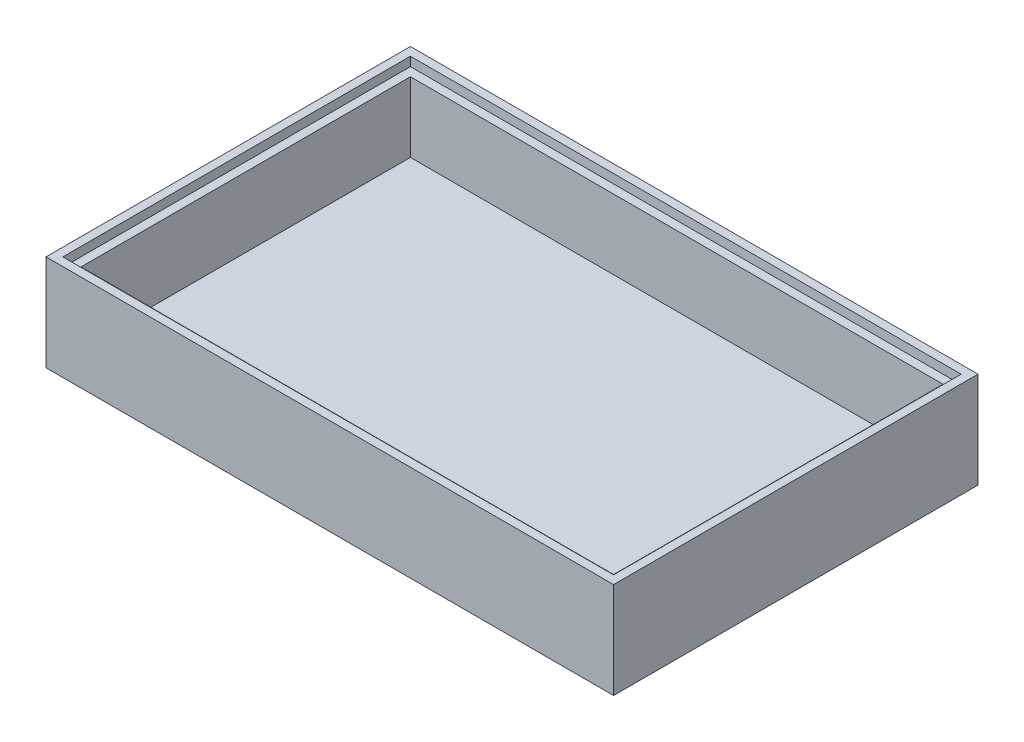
ISO-10303-21;
HEADER;
FILE_DESCRIPTION(('STEP AP214'),'2;1');
FILE_NAME('part.step','',(''),(''),'','','');
FILE_SCHEMA(('AUTOMOTIVE_DESIGN { 1 0 10303 214 1 1 1 1 }'));
ENDSEC;
DATA;
#1=APPLICATION_CONTEXT('core data for automotive mechanical design processes');
#2=APPLICATION_PROTOCOL_DEFINITION('international standard','automotive_design',2000,#1);
#3=PRODUCT_CONTEXT('',#1,'mechanical');
#4=PRODUCT('Part','Part','',(#3));
#5=PRODUCT_RELATED_PRODUCT_CATEGORY('part','',(#4));
#6=PRODUCT_DEFINITION_FORMATION('','',#4);
#7=PRODUCT_DEFINITION_CONTEXT('part definition',#1,'design');
#8=PRODUCT_DEFINITION('design','',#6,#7);
#9=PRODUCT_DEFINITION_SHAPE('','',#8);
#10=(LENGTH_UNIT() NAMED_UNIT(*) SI_UNIT(.MILLI.,.METRE.));
#11=(NAMED_UNIT(*) PLANE_ANGLE_UNIT() SI_UNIT($,.RADIAN.));
#12=(NAMED_UNIT(*) SI_UNIT($,.STERADIAN.) SOLID_ANGLE_UNIT());
#13=UNCERTAINTY_MEASURE_WITH_UNIT(LENGTH_MEASURE(1.E-05),#10,'distance_accuracy_value','');
#14=(GEOMETRIC_REPRESENTATION_CONTEXT(3) GLOBAL_UNCERTAINTY_ASSIGNED_CONTEXT((#13)) GLOBAL_UNIT_ASSIGNED_CONTEXT((#10,
#11,#12)) REPRESENTATION_CONTEXT('',''));
#15=CARTESIAN_POINT('',(0.,0.,0.));
#16=DIRECTION('',(0.,0.,1.));
#17=DIRECTION('',(1.,0.,0.));
#18=AXIS2_PLACEMENT_3D('',#15,#16,#17);
#19=CARTESIAN_POINT('',(0.,20.,83.4381346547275));
#20=DIRECTION('',(0.,1.,0.));
#21=DIRECTION('',(0.,0.,1.));
#22=AXIS2_PLACEMENT_3D('',#19,#20,#21);
#23=PLANE('',#22);
#24=DIRECTION('',(-1.,0.,0.));
#25=VECTOR('',#24,1.);
#26=CARTESIAN_POINT('',(0.,20.,2.));
#27=LINE('',#26,#25);
#28=CARTESIAN_POINT('',(127.966417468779,20.,2.00000000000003));
#29=VERTEX_POINT('',#28);
#30=CARTESIAN_POINT('',(2.,20.,2.));
#31=VERTEX_POINT('',#30);
#32=EDGE_CURVE('E173',#29,#31,#27,.T.);
#33=ORIENTED_EDGE('',*,*,#32,.T.);
#34=DIRECTION('',(0.,0.,1.));
#35=VECTOR('',#34,1.);
#36=CARTESIAN_POINT('',(2.,20.,83.4381346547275));
#37=LINE('',#36,#35);
#38=CARTESIAN_POINT('',(2.,20.,81.4381346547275));
#39=VERTEX_POINT('',#38);
#40=EDGE_CURVE('E170',#31,#39,#37,.T.);
#41=ORIENTED_EDGE('',*,*,#40,.T.);
#42=DIRECTION('',(1.,0.,0.));
#43=VECTOR('',#42,1.);
#44=CARTESIAN_POINT('',(0.,20.,81.4381346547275));
#45=LINE('',#44,#43);
#46=CARTESIAN_POINT('',(127.966417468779,20.,81.4381346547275));
#47=VERTEX_POINT('',#46);
#48=EDGE_CURVE('E69',#39,#47,#45,.T.);
#49=ORIENTED_EDGE('',*,*,#48,.T.);
#50=DIRECTION('',(0.,0.,-1.));
#51=VECTOR('',#50,1.);
#52=CARTESIAN_POINT('',(127.966417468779,20.,83.4381346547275));
#53=LINE('',#52,#51);
#54=EDGE_CURVE('E64',#47,#29,#53,.T.);
#55=ORIENTED_EDGE('',*,*,#54,.T.);
#56=EDGE_LOOP('',(#33,#41,#49,#55));
#57=FACE_BOUND('',#56,.T.);
#58=DIRECTION('',(0.,0.,1.));
#59=VECTOR('',#58,1.);
#60=CARTESIAN_POINT('',(4.,20.,0.));
#61=LINE('',#60,#59);
#62=CARTESIAN_POINT('',(4.,20.,4.));
#63=VERTEX_POINT('',#62);
#64=CARTESIAN_POINT('',(4.,20.,79.4381346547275));
#65=VERTEX_POINT('',#64);
#66=EDGE_CURVE('E216',#63,#65,#61,.T.);
#67=ORIENTED_EDGE('',*,*,#66,.F.);
#68=DIRECTION('',(-1.,0.,0.));
#69=VECTOR('',#68,1.);
#70=CARTESIAN_POINT('',(0.,20.,4.));
#71=LINE('',#70,#69);
#72=CARTESIAN_POINT('',(125.966417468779,20.,4.));
#73=VERTEX_POINT('',#72);
#74=EDGE_CURVE('E206',#73,#63,#71,.T.);
#75=ORIENTED_EDGE('',*,*,#74,.F.);
#76=DIRECTION('',(0.,0.,-1.));
#77=VECTOR('',#76,1.);
#78=CARTESIAN_POINT('',(125.966417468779,20.,0.));
#79=LINE('',#78,#77);
#80=CARTESIAN_POINT('',(125.966417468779,20.,79.4381346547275));
#81=VERTEX_POINT('',#80);
#82=EDGE_CURVE('E220',#81,#73,#79,.T.);
#83=ORIENTED_EDGE('',*,*,#82,.F.);
#84=DIRECTION('',(1.,0.,0.));
#85=VECTOR('',#84,1.);
#86=CARTESIAN_POINT('',(0.,20.,79.4381346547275));
#87=LINE('',#86,#85);
#88=EDGE_CURVE('E218',#65,#81,#87,.T.);
#89=ORIENTED_EDGE('',*,*,#88,.F.);
#90=EDGE_LOOP('',(#67,#75,#83,#89));
#91=FACE_BOUND('',#90,.T.);
#92=ADVANCED_FACE('F49',(#57,#91),#23,.T.);
#93=CARTESIAN_POINT('',(4.,20.,0.));
#94=DIRECTION('',(1.,0.,0.));
#95=DIRECTION('',(0.,0.,-1.));
#96=AXIS2_PLACEMENT_3D('',#93,#94,#95);
#97=PLANE('',#96);
#98=DIRECTION('',(0.,0.,1.));
#99=VECTOR('',#98,1.);
#100=CARTESIAN_POINT('',(4.,4.,0.));
#101=LINE('',#100,#99);
#102=CARTESIAN_POINT('',(4.,4.,4.));
#103=VERTEX_POINT('',#102);
#104=CARTESIAN_POINT('',(4.,4.,79.4381346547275));
#105=VERTEX_POINT('',#104);
#106=EDGE_CURVE('E182',#103,#105,#101,.T.);
#107=ORIENTED_EDGE('',*,*,#106,.F.);
#108=DIRECTION('',(0.,-1.,0.));
#109=VECTOR('',#108,1.);
#110=CARTESIAN_POINT('',(4.,20.,4.));
#111=LINE('',#110,#109);
#112=EDGE_CURVE('E202',#63,#103,#111,.T.);
#113=ORIENTED_EDGE('',*,*,#112,.F.);
#114=ORIENTED_EDGE('',*,*,#66,.T.);
#115=DIRECTION('',(0.,-1.,0.));
#116=VECTOR('',#115,1.);
#117=CARTESIAN_POINT('',(4.,20.,79.4381346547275));
#118=LINE('',#117,#116);
#119=EDGE_CURVE('E197',#65,#105,#118,.T.);
#120=ORIENTED_EDGE('',*,*,#119,.T.);
#121=EDGE_LOOP('',(#107,#113,#114,#120));
#122=FACE_BOUND('',#121,.T.);
#123=ADVANCED_FACE('F245',(#122),#97,.T.);
#124=CARTESIAN_POINT('',(0.,20.,79.4381346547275));
#125=DIRECTION('',(0.,0.,-1.));
#126=DIRECTION('',(-1.,0.,0.));
#127=AXIS2_PLACEMENT_3D('',#124,#125,#126);
#128=PLANE('',#127);
#129=DIRECTION('',(1.,0.,0.));
#130=VECTOR('',#129,1.);
#131=CARTESIAN_POINT('',(0.,4.,79.4381346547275));
#132=LINE('',#131,#130);
#133=CARTESIAN_POINT('',(125.966417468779,4.,79.4381346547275));
#134=VERTEX_POINT('',#133);
#135=EDGE_CURVE('E196',#105,#134,#132,.T.);
#136=ORIENTED_EDGE('',*,*,#135,.F.);
#137=ORIENTED_EDGE('',*,*,#119,.F.);
#138=ORIENTED_EDGE('',*,*,#88,.T.);
#139=DIRECTION('',(0.,-1.,0.));
#140=VECTOR('',#139,1.);
#141=CARTESIAN_POINT('',(125.966417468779,20.,79.4381346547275));
#142=LINE('',#141,#140);
#143=EDGE_CURVE('E201',#81,#134,#142,.T.);
#144=ORIENTED_EDGE('',*,*,#143,.T.);
#145=EDGE_LOOP('',(#136,#137,#138,#144));
#146=FACE_BOUND('',#145,.T.);
#147=ADVANCED_FACE('F250',(#146),#128,.T.);
#148=CARTESIAN_POINT('',(125.966417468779,20.,0.));
#149=DIRECTION('',(-1.,0.,0.));
#150=DIRECTION('',(0.,0.,1.));
#151=AXIS2_PLACEMENT_3D('',#148,#149,#150);
#152=PLANE('',#151);
#153=DIRECTION('',(0.,0.,-1.));
#154=VECTOR('',#153,1.);
#155=CARTESIAN_POINT('',(125.966417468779,4.,0.));
#156=LINE('',#155,#154);
#157=CARTESIAN_POINT('',(125.966417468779,4.,4.));
#158=VERTEX_POINT('',#157);
#159=EDGE_CURVE('E208',#134,#158,#156,.T.);
#160=ORIENTED_EDGE('',*,*,#159,.F.);
#161=ORIENTED_EDGE('',*,*,#143,.F.);
#162=ORIENTED_EDGE('',*,*,#82,.T.);
#163=DIRECTION('',(0.,-1.,0.));
#164=VECTOR('',#163,1.);
#165=CARTESIAN_POINT('',(125.966417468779,20.,4.));
#166=LINE('',#165,#164);
#167=EDGE_CURVE('E205',#73,#158,#166,.T.);
#168=ORIENTED_EDGE('',*,*,#167,.T.);
#169=EDGE_LOOP('',(#160,#161,#162,#168));
#170=FACE_BOUND('',#169,.T.);
#171=ADVANCED_FACE('F321',(#170),#152,.T.);
#172=CARTESIAN_POINT('',(0.,20.,4.));
#173=DIRECTION('',(0.,0.,1.));
#174=DIRECTION('',(1.,0.,0.));
#175=AXIS2_PLACEMENT_3D('',#172,#173,#174);
#176=PLANE('',#175);
#177=DIRECTION('',(-1.,0.,0.));
#178=VECTOR('',#177,1.);
#179=CARTESIAN_POINT('',(0.,4.,4.));
#180=LINE('',#179,#178);
#181=EDGE_CURVE('E212',#158,#103,#180,.T.);
#182=ORIENTED_EDGE('',*,*,#181,.F.);
#183=ORIENTED_EDGE('',*,*,#167,.F.);
#184=ORIENTED_EDGE('',*,*,#74,.T.);
#185=ORIENTED_EDGE('',*,*,#112,.T.);
#186=EDGE_LOOP('',(#182,#183,#184,#185));
#187=FACE_BOUND('',#186,.T.);
#188=ADVANCED_FACE('F330',(#187),#176,.T.);
#189=CARTESIAN_POINT('',(0.,4.,83.4381346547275));
#190=DIRECTION('',(0.,1.,0.));
#191=DIRECTION('',(0.,0.,1.));
#192=AXIS2_PLACEMENT_3D('',#189,#190,#191);
#193=PLANE('',#192);
#194=ORIENTED_EDGE('',*,*,#106,.T.);
#195=ORIENTED_EDGE('',*,*,#135,.T.);
#196=ORIENTED_EDGE('',*,*,#159,.T.);
#197=ORIENTED_EDGE('',*,*,#181,.T.);
#198=EDGE_LOOP('',(#194,#195,#196,#197));
#199=FACE_BOUND('',#198,.T.);
#200=ADVANCED_FACE('F256',(#199),#193,.T.);
#201=CARTESIAN_POINT('',(0.,20.,2.));
#202=DIRECTION('',(0.,0.0348994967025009,0.999390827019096));
#203=DIRECTION('',(0.,-0.999390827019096,0.0348994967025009));
#204=AXIS2_PLACEMENT_3D('',#201,#202,#203);
#205=PLANE('',#204);
#206=ORIENTED_EDGE('',*,*,#32,.F.);
#207=DIRECTION('',(-0.0348782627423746,-0.998782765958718,0.0348782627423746));
#208=VECTOR('',#207,1.);
#209=CARTESIAN_POINT('',(127.810747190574,15.5421864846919,2.15567027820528));
#210=LINE('',#209,#208);
#211=CARTESIAN_POINT('',(128.036259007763,22.,1.93015846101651));
#212=VERTEX_POINT('',#211);
#213=EDGE_CURVE('E180',#212,#29,#210,.T.);
#214=ORIENTED_EDGE('',*,*,#213,.F.);
#215=DIRECTION('',(-1.,0.,0.));
#216=VECTOR('',#215,1.);
#217=CARTESIAN_POINT('',(0.,22.,1.93015846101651));
#218=LINE('',#217,#216);
#219=CARTESIAN_POINT('',(1.9301584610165,22.,1.93015846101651));
#220=VERTEX_POINT('',#219);
#221=EDGE_CURVE('E187',#212,#220,#218,.T.);
#222=ORIENTED_EDGE('',*,*,#221,.T.);
#223=DIRECTION('',(0.0348782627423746,-0.998782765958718,0.0348782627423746));
#224=VECTOR('',#223,1.);
#225=CARTESIAN_POINT('',(2.0990689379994,17.1630367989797,2.09906893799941));
#226=LINE('',#225,#224);
#227=EDGE_CURVE('E161',#220,#31,#226,.T.);
#228=ORIENTED_EDGE('',*,*,#227,.T.);
#229=EDGE_LOOP('',(#206,#214,#222,#228));
#230=FACE_BOUND('',#229,.T.);
#231=ADVANCED_FACE('F345',(#230),#205,.T.);
#232=CARTESIAN_POINT('',(127.966417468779,20.,83.4381346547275));
#233=DIRECTION('',(-0.999390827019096,0.0348994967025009,0.));
#234=DIRECTION('',(-0.0348994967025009,-0.999390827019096,0.));
#235=AXIS2_PLACEMENT_3D('',#232,#233,#234);
#236=PLANE('',#235);
#237=ORIENTED_EDGE('',*,*,#54,.F.);
#238=DIRECTION('',(-0.0348782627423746,-0.998782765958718,-0.0348782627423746));
#239=VECTOR('',#238,1.);
#240=CARTESIAN_POINT('',(127.968850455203,20.0696716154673,81.4405676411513));
#241=LINE('',#240,#239);
#242=CARTESIAN_POINT('',(128.036259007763,22.,81.507976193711));
#243=VERTEX_POINT('',#242);
#244=EDGE_CURVE('E179',#243,#47,#241,.T.);
#245=ORIENTED_EDGE('',*,*,#244,.F.);
#246=DIRECTION('',(0.,0.,-1.));
#247=VECTOR('',#246,1.);
#248=CARTESIAN_POINT('',(128.036259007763,22.,83.4381346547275));
#249=LINE('',#248,#247);
#250=EDGE_CURVE('E186',#243,#212,#249,.T.);
#251=ORIENTED_EDGE('',*,*,#250,.T.);
#252=ORIENTED_EDGE('',*,*,#213,.T.);
#253=EDGE_LOOP('',(#237,#245,#251,#252));
#254=FACE_BOUND('',#253,.T.);
#255=ADVANCED_FACE('F352',(#254),#236,.T.);
#256=CARTESIAN_POINT('',(0.,20.,81.4381346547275));
#257=DIRECTION('',(0.,0.0348994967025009,-0.999390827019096));
#258=DIRECTION('',(0.,0.999390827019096,0.0348994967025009));
#259=AXIS2_PLACEMENT_3D('',#256,#257,#258);
#260=PLANE('',#259);
#261=ORIENTED_EDGE('',*,*,#48,.F.);
#262=DIRECTION('',(0.0348782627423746,-0.998782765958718,-0.0348782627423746));
#263=VECTOR('',#262,1.);
#264=CARTESIAN_POINT('',(1.99756701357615,20.0696716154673,81.4405676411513));
#265=LINE('',#264,#263);
#266=CARTESIAN_POINT('',(1.9301584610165,22.,81.507976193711));
#267=VERTEX_POINT('',#266);
#268=EDGE_CURVE('E165',#267,#39,#265,.T.);
#269=ORIENTED_EDGE('',*,*,#268,.F.);
#270=DIRECTION('',(1.,0.,0.));
#271=VECTOR('',#270,1.);
#272=CARTESIAN_POINT('',(0.,22.,81.507976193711));
#273=LINE('',#272,#271);
#274=EDGE_CURVE('E172',#267,#243,#273,.T.);
#275=ORIENTED_EDGE('',*,*,#274,.T.);
#276=ORIENTED_EDGE('',*,*,#244,.T.);
#277=EDGE_LOOP('',(#261,#269,#275,#276));
#278=FACE_BOUND('',#277,.T.);
#279=ADVANCED_FACE('F361',(#278),#260,.T.);
#280=CARTESIAN_POINT('',(2.,20.,83.4381346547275));
#281=DIRECTION('',(0.999390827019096,0.0348994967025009,0.));
#282=DIRECTION('',(-0.0348994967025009,0.999390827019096,0.));
#283=AXIS2_PLACEMENT_3D('',#280,#281,#282);
#284=PLANE('',#283);
#285=ORIENTED_EDGE('',*,*,#40,.F.);
#286=ORIENTED_EDGE('',*,*,#227,.F.);
#287=DIRECTION('',(0.,0.,1.));
#288=VECTOR('',#287,1.);
#289=CARTESIAN_POINT('',(1.9301584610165,22.,83.4381346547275));
#290=LINE('',#289,#288);
#291=EDGE_CURVE('E158',#220,#267,#290,.T.);
#292=ORIENTED_EDGE('',*,*,#291,.T.);
#293=ORIENTED_EDGE('',*,*,#268,.T.);
#294=EDGE_LOOP('',(#285,#286,#292,#293));
#295=FACE_BOUND('',#294,.T.);
#296=ADVANCED_FACE('F370',(#295),#284,.T.);
#297=CARTESIAN_POINT('',(0.,22.,83.4381346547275));
#298=DIRECTION('',(0.,1.,0.));
#299=DIRECTION('',(0.,0.,1.));
#300=AXIS2_PLACEMENT_3D('',#297,#298,#299);
#301=PLANE('',#300);
#302=ORIENTED_EDGE('',*,*,#221,.F.);
#303=ORIENTED_EDGE('',*,*,#250,.F.);
#304=ORIENTED_EDGE('',*,*,#274,.F.);
#305=ORIENTED_EDGE('',*,*,#291,.F.);
#306=EDGE_LOOP('',(#302,#303,#304,#305));
#307=FACE_BOUND('',#306,.T.);
#308=DIRECTION('',(0.,0.,1.));
#309=VECTOR('',#308,1.);
#310=CARTESIAN_POINT('',(0.,22.,0.));
#311=LINE('',#310,#309);
#312=CARTESIAN_POINT('',(0.,22.,0.));
#313=VERTEX_POINT('',#312);
#314=CARTESIAN_POINT('',(0.,22.,83.4381346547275));
#315=VERTEX_POINT('',#314);
#316=EDGE_CURVE('E155',#313,#315,#311,.T.);
#317=ORIENTED_EDGE('',*,*,#316,.T.);
#318=DIRECTION('',(1.,0.,0.));
#319=VECTOR('',#318,1.);
#320=CARTESIAN_POINT('',(0.,22.,83.4381346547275));
#321=LINE('',#320,#319);
#322=CARTESIAN_POINT('',(129.966417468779,22.,83.4381346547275));
#323=VERTEX_POINT('',#322);
#324=EDGE_CURVE('E162',#315,#323,#321,.T.);
#325=ORIENTED_EDGE('',*,*,#324,.T.);
#326=DIRECTION('',(0.,0.,-1.));
#327=VECTOR('',#326,1.);
#328=CARTESIAN_POINT('',(129.966417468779,22.,0.));
#329=LINE('',#328,#327);
#330=CARTESIAN_POINT('',(129.966417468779,22.,0.));
#331=VERTEX_POINT('',#330);
#332=EDGE_CURVE('E157',#323,#331,#329,.T.);
#333=ORIENTED_EDGE('',*,*,#332,.T.);
#334=DIRECTION('',(-1.,0.,0.));
#335=VECTOR('',#334,1.);
#336=CARTESIAN_POINT('',(0.,22.,0.));
#337=LINE('',#336,#335);
#338=EDGE_CURVE('E141',#331,#313,#337,.T.);
#339=ORIENTED_EDGE('',*,*,#338,.T.);
#340=EDGE_LOOP('',(#317,#325,#333,#339));
#341=FACE_BOUND('',#340,.T.);
#342=ADVANCED_FACE('F153',(#307,#341),#301,.T.);
#343=CARTESIAN_POINT('',(0.,0.,83.4381346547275));
#344=DIRECTION('',(0.,1.,0.));
#345=DIRECTION('',(0.,0.,1.));
#346=AXIS2_PLACEMENT_3D('',#343,#344,#345);
#347=PLANE('',#346);
#348=DIRECTION('',(0.,0.,1.));
#349=VECTOR('',#348,1.);
#350=CARTESIAN_POINT('',(0.,0.,0.));
#351=LINE('',#350,#349);
#352=CARTESIAN_POINT('',(0.,0.,0.));
#353=VERTEX_POINT('',#352);
#354=CARTESIAN_POINT('',(0.,0.,83.4381346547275));
#355=VERTEX_POINT('',#354);
#356=EDGE_CURVE('E200',#353,#355,#351,.T.);
#357=ORIENTED_EDGE('',*,*,#356,.F.);
#358=DIRECTION('',(-1.,0.,0.));
#359=VECTOR('',#358,1.);
#360=CARTESIAN_POINT('',(0.,0.,0.));
#361=LINE('',#360,#359);
#362=CARTESIAN_POINT('',(129.966417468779,0.,0.));
#363=VERTEX_POINT('',#362);
#364=EDGE_CURVE('E143',#363,#353,#361,.T.);
#365=ORIENTED_EDGE('',*,*,#364,.F.);
#366=DIRECTION('',(0.,0.,-1.));
#367=VECTOR('',#366,1.);
#368=CARTESIAN_POINT('',(129.966417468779,0.,0.));
#369=LINE('',#368,#367);
#370=CARTESIAN_POINT('',(129.966417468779,0.,83.4381346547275));
#371=VERTEX_POINT('',#370);
#372=EDGE_CURVE('E227',#371,#363,#369,.T.);
#373=ORIENTED_EDGE('',*,*,#372,.F.);
#374=DIRECTION('',(1.,0.,0.));
#375=VECTOR('',#374,1.);
#376=CARTESIAN_POINT('',(0.,0.,83.4381346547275));
#377=LINE('',#376,#375);
#378=EDGE_CURVE('E225',#355,#371,#377,.T.);
#379=ORIENTED_EDGE('',*,*,#378,.F.);
#380=EDGE_LOOP('',(#357,#365,#373,#379));
#381=FACE_BOUND('',#380,.T.);
#382=ADVANCED_FACE('F236',(#381),#347,.F.);
#383=CARTESIAN_POINT('',(0.,20.,0.));
#384=DIRECTION('',(0.,0.,1.));
#385=DIRECTION('',(1.,0.,0.));
#386=AXIS2_PLACEMENT_3D('',#383,#384,#385);
#387=PLANE('',#386);
#388=ORIENTED_EDGE('',*,*,#364,.T.);
#389=DIRECTION('',(0.,-1.,0.));
#390=VECTOR('',#389,1.);
#391=CARTESIAN_POINT('',(0.,20.,0.));
#392=LINE('',#391,#390);
#393=EDGE_CURVE('E137',#313,#353,#392,.T.);
#394=ORIENTED_EDGE('',*,*,#393,.F.);
#395=ORIENTED_EDGE('',*,*,#338,.F.);
#396=DIRECTION('',(0.,-1.,0.));
#397=VECTOR('',#396,1.);
#398=CARTESIAN_POINT('',(129.966417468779,20.,0.));
#399=LINE('',#398,#397);
#400=EDGE_CURVE('E148',#331,#363,#399,.T.);
#401=ORIENTED_EDGE('',*,*,#400,.T.);
#402=EDGE_LOOP('',(#388,#394,#395,#401));
#403=FACE_BOUND('',#402,.T.);
#404=ADVANCED_FACE('F139',(#403),#387,.F.);
#405=CARTESIAN_POINT('',(129.966417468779,20.,0.));
#406=DIRECTION('',(-1.,0.,0.));
#407=DIRECTION('',(0.,0.,1.));
#408=AXIS2_PLACEMENT_3D('',#405,#406,#407);
#409=PLANE('',#408);
#410=ORIENTED_EDGE('',*,*,#372,.T.);
#411=ORIENTED_EDGE('',*,*,#400,.F.);
#412=ORIENTED_EDGE('',*,*,#332,.F.);
#413=DIRECTION('',(0.,-1.,0.));
#414=VECTOR('',#413,1.);
#415=CARTESIAN_POINT('',(129.966417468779,20.,83.4381346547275));
#416=LINE('',#415,#414);
#417=EDGE_CURVE('E57',#323,#371,#416,.T.);
#418=ORIENTED_EDGE('',*,*,#417,.T.);
#419=EDGE_LOOP('',(#410,#411,#412,#418));
#420=FACE_BOUND('',#419,.T.);
#421=ADVANCED_FACE('F233',(#420),#409,.F.);
#422=CARTESIAN_POINT('',(0.,20.,83.4381346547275));
#423=DIRECTION('',(0.,0.,-1.));
#424=DIRECTION('',(-1.,0.,0.));
#425=AXIS2_PLACEMENT_3D('',#422,#423,#424);
#426=PLANE('',#425);
#427=ORIENTED_EDGE('',*,*,#378,.T.);
#428=ORIENTED_EDGE('',*,*,#417,.F.);
#429=ORIENTED_EDGE('',*,*,#324,.F.);
#430=DIRECTION('',(0.,-1.,0.));
#431=VECTOR('',#430,1.);
#432=CARTESIAN_POINT('',(0.,20.,83.4381346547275));
#433=LINE('',#432,#431);
#434=EDGE_CURVE('E13',#315,#355,#433,.T.);
#435=ORIENTED_EDGE('',*,*,#434,.T.);
#436=EDGE_LOOP('',(#427,#428,#429,#435));
#437=FACE_BOUND('',#436,.T.);
#438=ADVANCED_FACE('F237',(#437),#426,.F.);
#439=CARTESIAN_POINT('',(0.,20.,0.));
#440=DIRECTION('',(1.,0.,0.));
#441=DIRECTION('',(0.,0.,-1.));
#442=AXIS2_PLACEMENT_3D('',#439,#440,#441);
#443=PLANE('',#442);
#444=ORIENTED_EDGE('',*,*,#356,.T.);
#445=ORIENTED_EDGE('',*,*,#434,.F.);
#446=ORIENTED_EDGE('',*,*,#316,.F.);
#447=ORIENTED_EDGE('',*,*,#393,.T.);
#448=EDGE_LOOP('',(#444,#445,#446,#447));
#449=FACE_BOUND('',#448,.T.);
#450=ADVANCED_FACE('F51',(#449),#443,.F.);
#451=CLOSED_SHELL('',(#92,#123,#147,#171,#188,#200,#231,#255,#279,#296,#342,#382,#404,#421,#438,#450));
#452=MANIFOLD_SOLID_BREP('B2',#451);
#453=ADVANCED_BREP_SHAPE_REPRESENTATION('',(#18,#452),#14);
#454=SHAPE_DEFINITION_REPRESENTATION(#9,#453);
ENDSEC;
END-ISO-10303-21;
